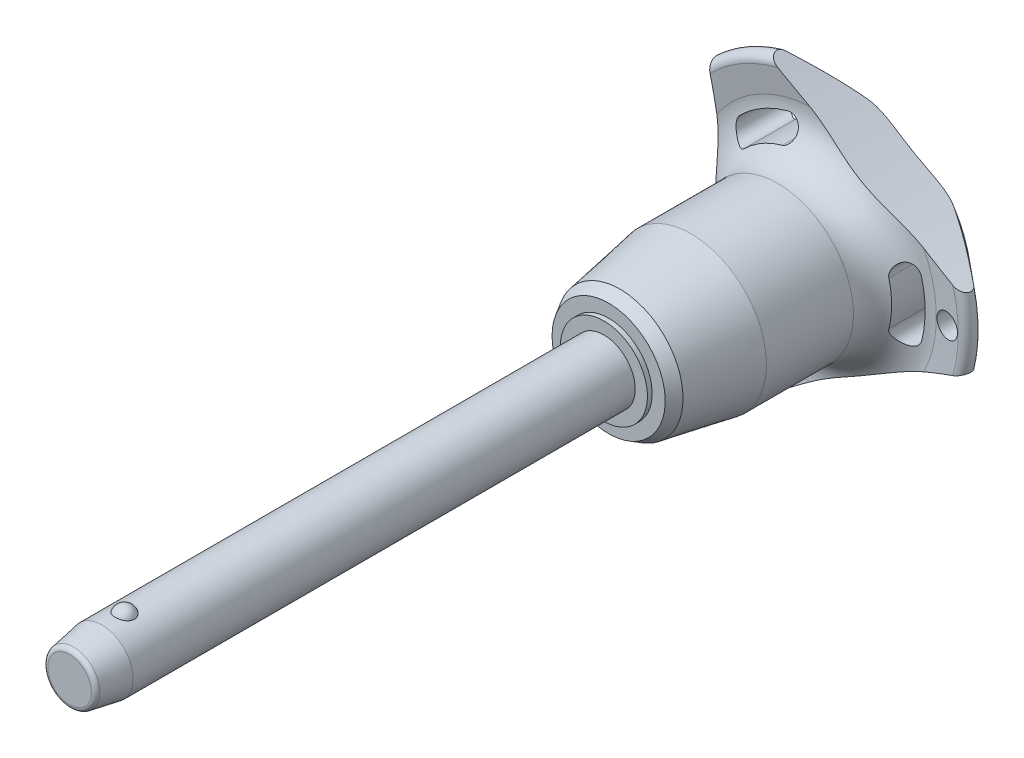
from build123d import *

# Parameters (mm, degrees)
SKETCH1_R           = 4
BOSS_EXTRUDE1_DEPTH = 60
SKETCH2_R           = 3.4
BOSS_EXTRUDE2_DEPTH = 33.3
BOSS_EXTRUDE3_START = 8.2
SKETCH1_2_R         = 4
BOSS_EXTRUDE3_DEPTH = 8.2
CHAMFER1_SIZE       = 4.1
CHAMFER1_SIZE2      = 0.722940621
FILLET1_R           = 0.6
SKETCH6_R           = 102.8
CUT_EXTRUDE1_DEPTH  = 98.333870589
CIRPATTERN1_COUNT   = 3
SKETCH7_R           = 1.5
CUT_EXTRUDE2_DEPTH  = 98.167560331


with BuildPart() as part:
    # Sketch1 → Boss-Extrude1 (new body)
    with BuildSketch(Plane.XY):
        Circle(SKETCH1_R)
    extrude(amount=-BOSS_EXTRUDE1_DEPTH)

    # Sketch2 → Boss-Extrude2 (add)
    with BuildSketch(Plane(origin=(0, 0, -60), x_dir=(-1, 0, 0), z_dir=(0, 0, -1))):
        Circle(SKETCH2_R)
    extrude(amount=BOSS_EXTRUDE2_DEPTH)

    # Sketch3 → Revolve1 (revolve)
    with BuildSketch(Plane(origin=(0, 0, 0), x_dir=(0, 0, -1), z_dir=(1, 0, 0))):
        with BuildLine():
            Line((-1.2, 4.8), (-1.2, 2.2))
            ThreePointArc((-1.2, 2.2), (0.1, 3.5), (-1.2, 4.8))
        make_face()
        with BuildLine():
            Line((-1.2, -2.2), (-1.2, -4.8))
            ThreePointArc((-1.2, -4.8), (0.1, -3.5), (-1.2, -2.2))
        make_face()
    revolve(axis=Axis((0, -2.2, 1.2), (0, 1, 0)))

    # Sketch1_2 → Boss-Extrude3 (add)
    with BuildSketch(Plane.XY.offset(BOSS_EXTRUDE3_START)):
        Circle(SKETCH1_2_R)
    extrude(amount=-BOSS_EXTRUDE3_DEPTH)

    # Chamfer1
    chamfer1_edges = [part.edges().sort_by_distance(p)[0] for p in [
        (-4, 0, 8.2),
    ]]
    chamfer1_side = [part.faces().sort_by_distance(p)[0] for p in [
        (-4, 0, -25.9),
    ]]
    chamfer(chamfer1_edges, length=CHAMFER1_SIZE, length2=CHAMFER1_SIZE2, reference=chamfer1_side[0])

    # Fillet1
    fillet1_edges = [part.edges().sort_by_distance(p)[0] for p in [
        (-3.277059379, 0, 8.2),
        (3.4, 0, -93.3),
    ]]
    fillet(fillet1_edges, radius=FILLET1_R)

    # Sketch4 → Revolve2 (revolve)
    with BuildSketch(Plane(origin=(0, 0, 0), x_dir=(0, 0, -1), z_dir=(1, 0, 0)), mode=Mode.PRIVATE) as revolve2_sk:
        Polygon((60, 0), (60, 5.554101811), (60.6, 5.554101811), (60.6, 7.220004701), (62.042714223, 8.052956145), (71.1, 9.65), (82.2, 9.65), (82.2, 0), align=None)
    revolve(revolve2_sk.sketch.rotate(Axis((0, 0, -82.2), (0, 0, 1)), 90), axis=Axis((0, 0, -82.2), (0, 0, 1)))

    # Sketch5 → Revolve3 (revolve)
    with BuildSketch(Plane(origin=(0, 0, 0), x_dir=(0, 0, -1), z_dir=(1, 0, 0)), mode=Mode.PRIVATE) as revolve3_sk:
        with BuildLine():
            Line((87.16082631, 15.274661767), (86.757834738, 18.475067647))
            ThreePointArc((86.757834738, 18.475067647), (87.349836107, 19.516443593), (88.516044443, 19.24278761))
            Line((88.516044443, 19.24278761), (92.835691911, 14.094832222))
            ThreePointArc((92.835691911, 14.094832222), (93.3, 12.689260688), (92.67067517, 11.349423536))
            ThreePointArc((92.67067517, 11.349423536), (89.033110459, 6.185112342), (87.75, 0))
            Line((87.75, 0), (82.2, 0))
            Line((82.2, 0), (82.2, 9.65))
            ThreePointArc((82.2, 9.65), (85.949887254, 11.342683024), (87.16082631, 15.274661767))
        make_face()
    revolve(revolve3_sk.sketch.rotate(Axis((0, 0, -87.75), (0, 0, 1)), 90), axis=Axis((0, 0, -87.75), (0, 0, 1)))

    # Sketch6 → Cut-Extrude1 (cut, through all)
    with BuildSketch(Plane.XY):
        with Locations((-115.2, 0)):
            Circle(SKETCH6_R)
        with BuildLine():
            ThreePointArc((13.411913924, -3.529271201), (13.868496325, 0), (13.411913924, 3.529271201))
            ThreePointArc((13.411913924, 3.529271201), (11.694200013, 4.531299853), (10.692171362, 2.813585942))
            ThreePointArc((10.692171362, 2.813585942), (11.056165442, 0), (10.692171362, -2.813585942))
            ThreePointArc((10.692171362, -2.813585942), (11.694200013, -4.531299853), (13.411913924, -3.529271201))
        make_face()
    cut_extrude1 = extrude(amount=-CUT_EXTRUDE1_DEPTH, mode=Mode.SUBTRACT)

    # CirPattern1: Cut-Extrude1 ×3 about axis
    cirpattern1_axis = Axis((0, 0, 0), (0, 0, 1))
    for i in range(1, CIRPATTERN1_COUNT):
        add(cut_extrude1.rotate(cirpattern1_axis, i * 360 / CIRPATTERN1_COUNT), mode=Mode.SUBTRACT)

    # Sketch7 → Cut-Extrude2 (cut, through all)
    with BuildSketch(Plane.XY):
        with Locations(Location((16.868496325, 0, 0), (0, 0, 225.467095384))):
            Circle(SKETCH7_R)
    extrude(amount=-CUT_EXTRUDE2_DEPTH, mode=Mode.SUBTRACT)


solid = part.part
